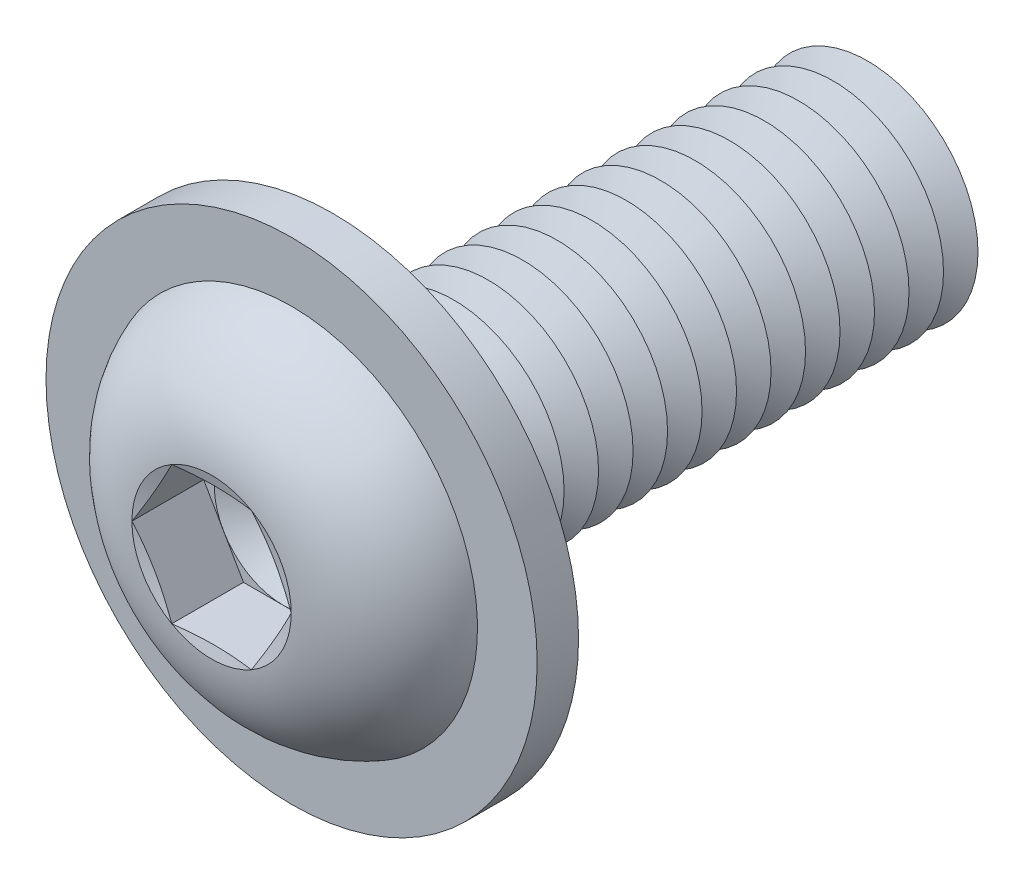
from build123d import *

# Parameters (mm, degrees)
FILLET1_R           = 0.625
LPATTERN1_COUNT     = 16
LPATTERN1_PITCH     = 1.25
CUT_EXTRUDE1_DEPTH  = 2.6
SKETCH5_R           = 8.9
SKETCH5_R_2         = 4.625
BOSS_EXTRUDE1_DEPTH = 1.5


with BuildPart() as part:
    # Sketch1 → Revolve1 (revolve)
    with BuildSketch(Plane(origin=(0, 0, 0), x_dir=(0, 0, -1), z_dir=(1, 0, 0)), mode=Mode.PRIVATE) as revolve1_sk:
        with BuildLine():
            Line((0, 4), (0, 7))
            ThreePointArc((0, 7), (-3.011595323, 5.81154966), (-4.4, 2.88675))
            Line((-4.4, 2.88675), (-4.013248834, 1.443375))
            Line((-4.013248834, 1.443375), (-4.4, 1.443375))
            Line((-4.4, 1.443375), (-4.4, 0))
            Line((-4.4, 0), (20, 0))
            Line((20, 0), (20, 4))
            Line((20, 4), (0, 4))
        make_face()
    revolve(revolve1_sk.sketch.rotate(Axis((0, 0, -20), (0, 0, 1)), 90), axis=Axis((0, 0, -20), (0, 0, 1)))

    # Fillet1
    fillet1_edges = [part.edges().sort_by_distance(p)[0] for p in [
        (4, 0, 0),
    ]]
    fillet(fillet1_edges, radius=FILLET1_R)

    # Sketch2 → Cut-Revolve1 (revolve, cut)
    with BuildSketch(Plane(origin=(0, 0, 0), x_dir=(0, 0, -1), z_dir=(1, 0, 0)), mode=Mode.PRIVATE) as cut_revolve1_sk:
        Polygon((19.375, 4), (20.625, 4), (20, 2.917468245), align=None)
    cut_revolve1 = revolve(cut_revolve1_sk.sketch.rotate(Axis((0, 0, -20), (0, 0, -1)), 270), axis=Axis((0, 0, -20), (0, 0, -1)), mode=Mode.SUBTRACT)

    # LPattern1: Cut-Revolve1 ×16
    with Locations(*[(0, 0, i * LPATTERN1_PITCH) for i in range(1, LPATTERN1_COUNT)]):
        add(cut_revolve1, mode=Mode.SUBTRACT)

    # Sketch3 → Cut-Extrude1 (cut)
    with BuildSketch(Plane.XY.offset(4.4)):
        Polygon((1.443375, 2.499998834), (-1.443375, 2.499998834), (-2.88675, 0), (-1.443375, -2.499998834), (1.443375, -2.499998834), (2.88675, 0), align=None)
    extrude(amount=-CUT_EXTRUDE1_DEPTH, mode=Mode.SUBTRACT)

    # Cut-Extrude2 cone 1 section (on through the dimple's axis) → Cut-Extrude2 (revolve, cut)
    with BuildSketch(Plane(origin=(0, 0, 1.8), x_dir=(0, -1, 0), z_dir=(1, 0, 0))):
        Polygon((0, 0), (2.499998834, 0), (0, 1.443375), align=None)
    revolve(axis=Axis((0, 0, 1.8), (0, 0, -1)), mode=Mode.SUBTRACT)

    # Sketch5 → Boss-Extrude1 (add)
    with BuildSketch(Plane(origin=(0, 0, 0), x_dir=(-1, 0, 0), z_dir=(0, 0, -1))):
        with Locations(Location((0, 0, 0), (0, 0, 90))):
            Circle(SKETCH5_R)
        Circle(SKETCH5_R_2, mode=Mode.SUBTRACT)
    extrude(amount=-BOSS_EXTRUDE1_DEPTH)


solid = part.part
